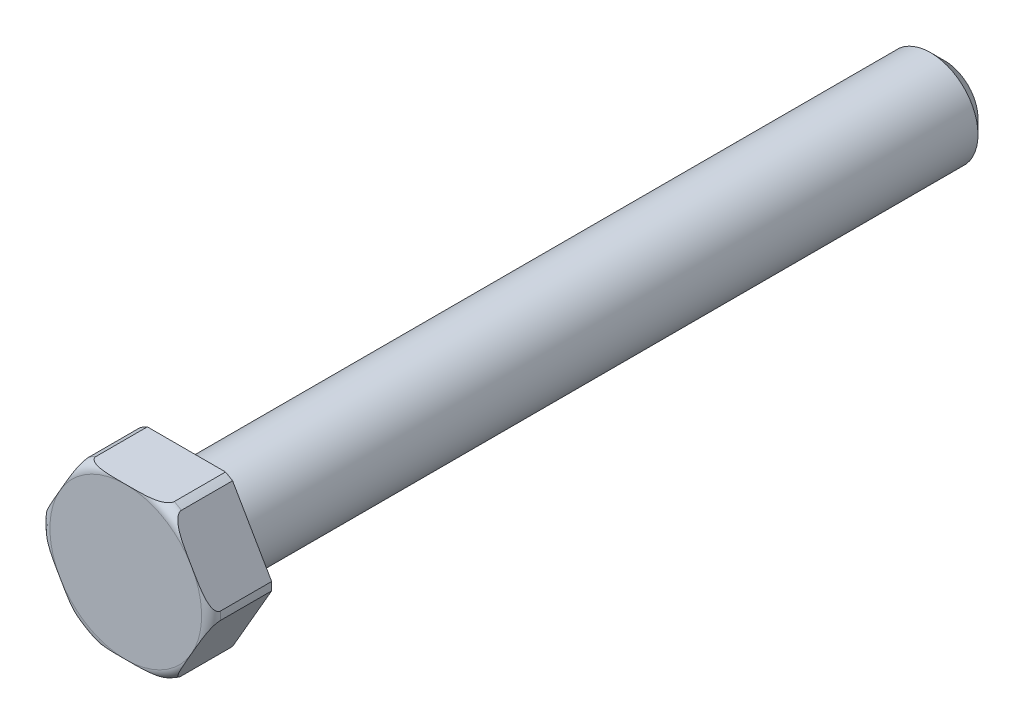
from build123d import *

# Parameters (mm, degrees)
ESQUISSE1_R             = 9
EXTRUSION1_DEPTH        = 6.4
CONG_1_R                = 1
ESQUISSE2_R             = 14.142135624
ENL_V_MAT_EXTRU_1_DEPTH = 15.246403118
ESQUISSE3_R             = 5
EXTRUSION2_DEPTH        = 80
CHANFREIN1_SIZE         = 1.5


with BuildPart() as part:
    # Esquisse1 → Extrusion1 (new body)
    with BuildSketch(Plane.XY):
        Circle(ESQUISSE1_R)
    extrude(amount=EXTRUSION1_DEPTH)

    # Cong_1
    cong_1_edges = [part.edges().sort_by_distance(p)[0] for p in [
        (-9, 0, 6.4),
    ]]
    fillet(cong_1_edges, radius=CONG_1_R)

    # Esquisse2 → Enl_v. mat.-Extru.1 (cut, through all)
    with BuildSketch(Plane.XY.offset(6.4)):
        Circle(ESQUISSE2_R)
        Polygon((9.237604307, 0), (4.618802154, 8), (-4.618802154, 8), (-9.237604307, 0), (-4.618802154, -8), (4.618802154, -8), align=None, mode=Mode.SUBTRACT)
    extrude(amount=-ENL_V_MAT_EXTRU_1_DEPTH, mode=Mode.SUBTRACT)

    # Esquisse3 → Extrusion2 (add)
    with BuildSketch(Plane(origin=(0, 0, 0), x_dir=(-1, 0, 0), z_dir=(0, 0, -1))):
        with Locations(Location((0, 0, 0), (0, 0, 180))):
            Circle(ESQUISSE3_R)
    extrude(amount=EXTRUSION2_DEPTH)

    # Chanfrein1
    chanfrein1_edges = [part.edges().sort_by_distance(p)[0] for p in [
        (-5, 0, -80),
    ]]
    chamfer(chanfrein1_edges, length=CHANFREIN1_SIZE)


solid = part.part
